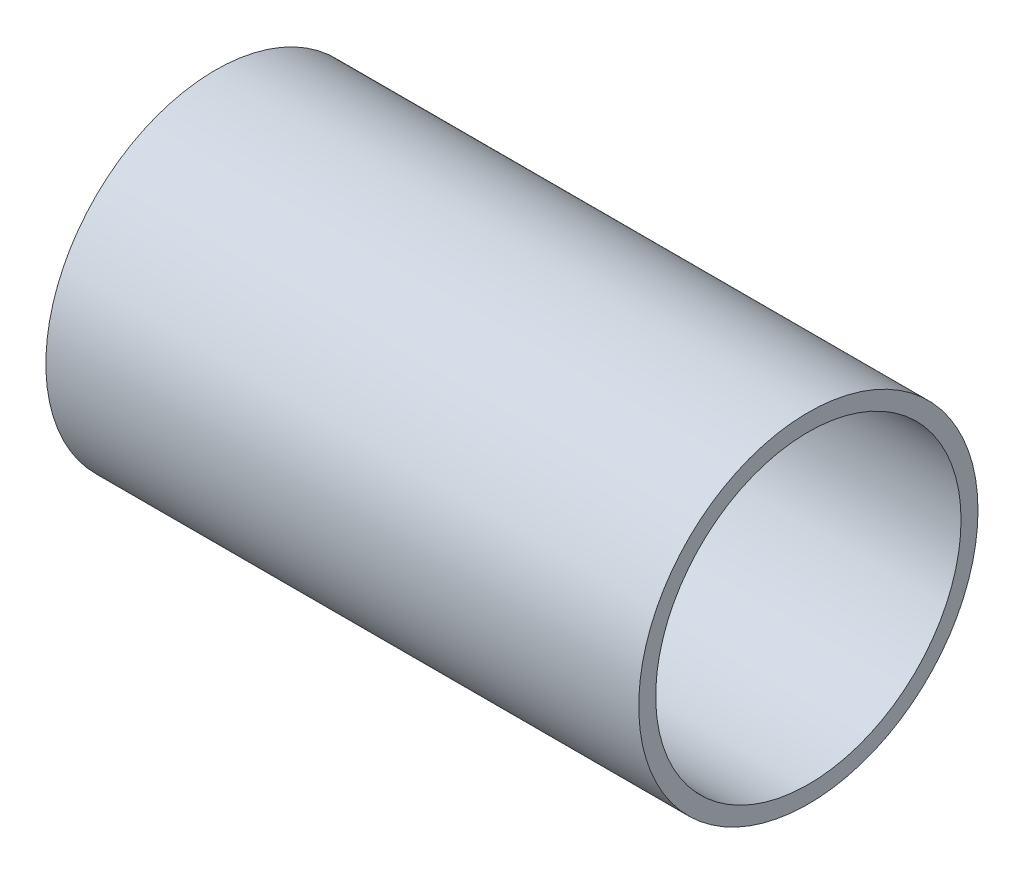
ISO-10303-21;
HEADER;
FILE_DESCRIPTION(('STEP AP214'),'2;1');
FILE_NAME('part.step','',(''),(''),'','','');
FILE_SCHEMA(('AUTOMOTIVE_DESIGN { 1 0 10303 214 1 1 1 1 }'));
ENDSEC;
DATA;
#1=APPLICATION_CONTEXT('core data for automotive mechanical design processes');
#2=APPLICATION_PROTOCOL_DEFINITION('international standard','automotive_design',2000,#1);
#3=PRODUCT_CONTEXT('',#1,'mechanical');
#4=PRODUCT('Part','Part','',(#3));
#5=PRODUCT_RELATED_PRODUCT_CATEGORY('part','',(#4));
#6=PRODUCT_DEFINITION_FORMATION('','',#4);
#7=PRODUCT_DEFINITION_CONTEXT('part definition',#1,'design');
#8=PRODUCT_DEFINITION('design','',#6,#7);
#9=PRODUCT_DEFINITION_SHAPE('','',#8);
#10=(LENGTH_UNIT() NAMED_UNIT(*) SI_UNIT(.MILLI.,.METRE.));
#11=(NAMED_UNIT(*) PLANE_ANGLE_UNIT() SI_UNIT($,.RADIAN.));
#12=(NAMED_UNIT(*) SI_UNIT($,.STERADIAN.) SOLID_ANGLE_UNIT());
#13=UNCERTAINTY_MEASURE_WITH_UNIT(LENGTH_MEASURE(1.E-05),#10,'distance_accuracy_value','');
#14=(GEOMETRIC_REPRESENTATION_CONTEXT(3) GLOBAL_UNCERTAINTY_ASSIGNED_CONTEXT((#13)) GLOBAL_UNIT_ASSIGNED_CONTEXT((#10,
#11,#12)) REPRESENTATION_CONTEXT('',''));
#15=CARTESIAN_POINT('',(0.,0.,0.));
#16=DIRECTION('',(0.,0.,1.));
#17=DIRECTION('',(1.,0.,0.));
#18=AXIS2_PLACEMENT_3D('',#15,#16,#17);
#19=CARTESIAN_POINT('',(0.,0.,0.));
#20=DIRECTION('',(1.,0.,0.));
#21=DIRECTION('',(0.,0.,-1.));
#22=AXIS2_PLACEMENT_3D('',#19,#20,#21);
#23=CYLINDRICAL_SURFACE('',#22,18.);
#24=CARTESIAN_POINT('',(-34.95,0.,0.));
#25=DIRECTION('',(1.,0.,0.));
#26=DIRECTION('',(0.,0.,-1.));
#27=AXIS2_PLACEMENT_3D('',#24,#25,#26);
#28=CIRCLE('',#27,18.);
#29=CARTESIAN_POINT('',(-34.95,0.,-18.));
#30=VERTEX_POINT('',#29);
#31=EDGE_CURVE('E17',#30,#30,#28,.F.);
#32=ORIENTED_EDGE('',*,*,#31,.T.);
#33=EDGE_LOOP('',(#32));
#34=FACE_BOUND('',#33,.T.);
#35=CARTESIAN_POINT('',(34.95,0.,0.));
#36=DIRECTION('',(1.,0.,0.));
#37=DIRECTION('',(0.,0.,-1.));
#38=AXIS2_PLACEMENT_3D('',#35,#36,#37);
#39=CIRCLE('',#38,18.);
#40=CARTESIAN_POINT('',(34.95,0.,-18.));
#41=VERTEX_POINT('',#40);
#42=EDGE_CURVE('E26',#41,#41,#39,.F.);
#43=ORIENTED_EDGE('',*,*,#42,.F.);
#44=EDGE_LOOP('',(#43));
#45=FACE_BOUND('',#44,.T.);
#46=ADVANCED_FACE('F14',(#34,#45),#23,.F.);
#47=CARTESIAN_POINT('',(-34.95,0.,0.));
#48=DIRECTION('',(1.,0.,0.));
#49=DIRECTION('',(0.,0.,-1.));
#50=AXIS2_PLACEMENT_3D('',#47,#48,#49);
#51=PLANE('',#50);
#52=ORIENTED_EDGE('',*,*,#31,.F.);
#53=EDGE_LOOP('',(#52));
#54=FACE_BOUND('',#53,.T.);
#55=CARTESIAN_POINT('',(-34.95,0.,0.));
#56=DIRECTION('',(1.,0.,0.));
#57=DIRECTION('',(0.,0.,-1.));
#58=AXIS2_PLACEMENT_3D('',#55,#56,#57);
#59=CIRCLE('',#58,20.);
#60=CARTESIAN_POINT('',(-34.95,0.,-20.));
#61=VERTEX_POINT('',#60);
#62=EDGE_CURVE('E21',#61,#61,#59,.T.);
#63=ORIENTED_EDGE('',*,*,#62,.F.);
#64=EDGE_LOOP('',(#63));
#65=FACE_BOUND('',#64,.T.);
#66=ADVANCED_FACE('F36',(#54,#65),#51,.F.);
#67=CARTESIAN_POINT('',(34.95,0.,0.));
#68=DIRECTION('',(1.,0.,0.));
#69=DIRECTION('',(0.,0.,-1.));
#70=AXIS2_PLACEMENT_3D('',#67,#68,#69);
#71=PLANE('',#70);
#72=ORIENTED_EDGE('',*,*,#42,.T.);
#73=EDGE_LOOP('',(#72));
#74=FACE_BOUND('',#73,.T.);
#75=CARTESIAN_POINT('',(34.95,0.,0.));
#76=DIRECTION('',(1.,0.,0.));
#77=DIRECTION('',(0.,0.,-1.));
#78=AXIS2_PLACEMENT_3D('',#75,#76,#77);
#79=CIRCLE('',#78,20.);
#80=CARTESIAN_POINT('',(34.95,0.,-20.));
#81=VERTEX_POINT('',#80);
#82=EDGE_CURVE('E10',#81,#81,#79,.F.);
#83=ORIENTED_EDGE('',*,*,#82,.F.);
#84=EDGE_LOOP('',(#83));
#85=FACE_BOUND('',#84,.T.);
#86=ADVANCED_FACE('F39',(#74,#85),#71,.T.);
#87=CARTESIAN_POINT('',(0.,0.,0.));
#88=DIRECTION('',(1.,0.,0.));
#89=DIRECTION('',(0.,0.,-1.));
#90=AXIS2_PLACEMENT_3D('',#87,#88,#89);
#91=CYLINDRICAL_SURFACE('',#90,20.);
#92=ORIENTED_EDGE('',*,*,#62,.T.);
#93=EDGE_LOOP('',(#92));
#94=FACE_BOUND('',#93,.T.);
#95=ORIENTED_EDGE('',*,*,#82,.T.);
#96=EDGE_LOOP('',(#95));
#97=FACE_BOUND('',#96,.T.);
#98=ADVANCED_FACE('F42',(#94,#97),#91,.T.);
#99=CLOSED_SHELL('',(#46,#66,#86,#98));
#100=MANIFOLD_SOLID_BREP('B1',#99);
#101=ADVANCED_BREP_SHAPE_REPRESENTATION('',(#18,#100),#14);
#102=SHAPE_DEFINITION_REPRESENTATION(#9,#101);
ENDSEC;
END-ISO-10303-21;
